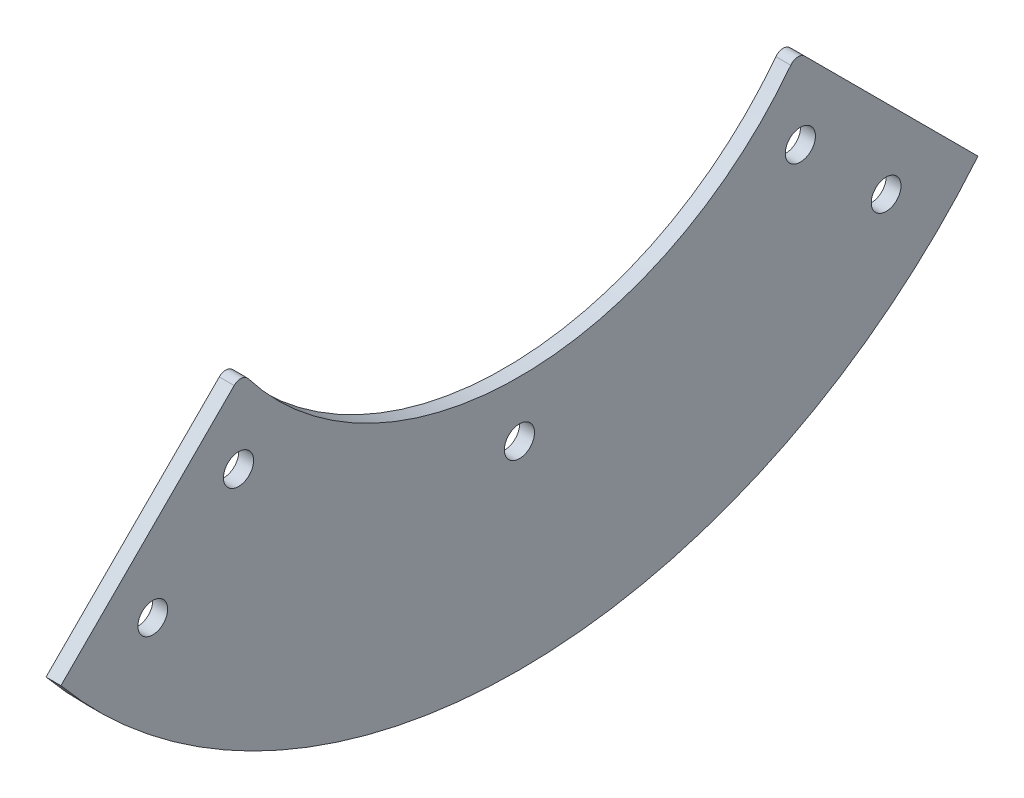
ISO-10303-21;
HEADER;
FILE_DESCRIPTION(('STEP AP214'),'2;1');
FILE_NAME('part.step','',(''),(''),'','','');
FILE_SCHEMA(('AUTOMOTIVE_DESIGN { 1 0 10303 214 1 1 1 1 }'));
ENDSEC;
DATA;
#1=APPLICATION_CONTEXT('core data for automotive mechanical design processes');
#2=APPLICATION_PROTOCOL_DEFINITION('international standard','automotive_design',2000,#1);
#3=PRODUCT_CONTEXT('',#1,'mechanical');
#4=PRODUCT('Part','Part','',(#3));
#5=PRODUCT_RELATED_PRODUCT_CATEGORY('part','',(#4));
#6=PRODUCT_DEFINITION_FORMATION('','',#4);
#7=PRODUCT_DEFINITION_CONTEXT('part definition',#1,'design');
#8=PRODUCT_DEFINITION('design','',#6,#7);
#9=PRODUCT_DEFINITION_SHAPE('','',#8);
#10=(LENGTH_UNIT() NAMED_UNIT(*) SI_UNIT(.MILLI.,.METRE.));
#11=(NAMED_UNIT(*) PLANE_ANGLE_UNIT() SI_UNIT($,.RADIAN.));
#12=(NAMED_UNIT(*) SI_UNIT($,.STERADIAN.) SOLID_ANGLE_UNIT());
#13=UNCERTAINTY_MEASURE_WITH_UNIT(LENGTH_MEASURE(1.E-05),#10,'distance_accuracy_value','');
#14=(GEOMETRIC_REPRESENTATION_CONTEXT(3) GLOBAL_UNCERTAINTY_ASSIGNED_CONTEXT((#13)) GLOBAL_UNIT_ASSIGNED_CONTEXT((#10,
#11,#12)) REPRESENTATION_CONTEXT('',''));
#15=CARTESIAN_POINT('',(0.,0.,0.));
#16=DIRECTION('',(0.,0.,1.));
#17=DIRECTION('',(1.,0.,0.));
#18=AXIS2_PLACEMENT_3D('',#15,#16,#17);
#19=CARTESIAN_POINT('',(4.,-98.55172785,-98.5517278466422));
#20=DIRECTION('',(-1.,0.,0.));
#21=DIRECTION('',(0.,0.,1.));
#22=AXIS2_PLACEMENT_3D('',#19,#20,#21);
#23=CYLINDRICAL_SURFACE('',#22,4.00000000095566);
#24=CARTESIAN_POINT('',(4.,-98.55172785,-98.5517278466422));
#25=DIRECTION('',(1.,0.,0.));
#26=DIRECTION('',(0.,0.,-1.));
#27=AXIS2_PLACEMENT_3D('',#24,#25,#26);
#28=CIRCLE('',#27,4.00000000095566);
#29=CARTESIAN_POINT('',(4.,-98.55172785,-102.551727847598));
#30=VERTEX_POINT('',#29);
#31=EDGE_CURVE('E483',#30,#30,#28,.T.);
#32=ORIENTED_EDGE('',*,*,#31,.T.);
#33=EDGE_LOOP('',(#32));
#34=FACE_BOUND('',#33,.T.);
#35=CARTESIAN_POINT('',(0.,-98.55172785,-98.5517278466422));
#36=DIRECTION('',(1.,0.,0.));
#37=DIRECTION('',(0.,0.,-1.));
#38=AXIS2_PLACEMENT_3D('',#35,#36,#37);
#39=CIRCLE('',#38,4.00000000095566);
#40=CARTESIAN_POINT('',(0.,-98.55172785,-102.551727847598));
#41=VERTEX_POINT('',#40);
#42=EDGE_CURVE('E406',#41,#41,#39,.T.);
#43=ORIENTED_EDGE('',*,*,#42,.F.);
#44=EDGE_LOOP('',(#43));
#45=FACE_BOUND('',#44,.T.);
#46=ADVANCED_FACE('F314',(#34,#45),#23,.F.);
#47=CARTESIAN_POINT('',(0.,0.,0.));
#48=DIRECTION('',(1.,0.,0.));
#49=DIRECTION('',(0.,0.,-1.));
#50=AXIS2_PLACEMENT_3D('',#47,#48,#49);
#51=PLANE('',#50);
#52=CARTESIAN_POINT('',(0.,-75.496317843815,-75.4963178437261));
#53=DIRECTION('',(1.,0.,0.));
#54=DIRECTION('',(0.,0.,-1.));
#55=AXIS2_PLACEMENT_3D('',#52,#53,#54);
#56=CIRCLE('',#55,4.04999999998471);
#57=CARTESIAN_POINT('',(0.,-75.496317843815,-79.5463178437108));
#58=VERTEX_POINT('',#57);
#59=EDGE_CURVE('E397',#58,#58,#56,.T.);
#60=ORIENTED_EDGE('',*,*,#59,.T.);
#61=EDGE_LOOP('',(#60));
#62=FACE_BOUND('',#61,.T.);
#63=CARTESIAN_POINT('',(0.,-75.4963178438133,75.4963178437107));
#64=DIRECTION('',(1.,0.,0.));
#65=DIRECTION('',(0.,0.,-1.));
#66=AXIS2_PLACEMENT_3D('',#63,#64,#65);
#67=CIRCLE('',#66,4.04999999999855);
#68=CARTESIAN_POINT('',(0.,-75.4963178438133,71.4463178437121));
#69=VERTEX_POINT('',#68);
#70=EDGE_CURVE('E400',#69,#69,#67,.T.);
#71=ORIENTED_EDGE('',*,*,#70,.T.);
#72=EDGE_LOOP('',(#71));
#73=FACE_BOUND('',#72,.T.);
#74=CARTESIAN_POINT('',(0.,-98.55172785,98.55172785));
#75=DIRECTION('',(1.,0.,0.));
#76=DIRECTION('',(0.,0.,-1.));
#77=AXIS2_PLACEMENT_3D('',#74,#75,#76);
#78=CIRCLE('',#77,4.00000000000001);
#79=CARTESIAN_POINT('',(0.,-98.55172785,94.55172785));
#80=VERTEX_POINT('',#79);
#81=EDGE_CURVE('E403',#80,#80,#78,.T.);
#82=ORIENTED_EDGE('',*,*,#81,.T.);
#83=EDGE_LOOP('',(#82));
#84=FACE_BOUND('',#83,.T.);
#85=ORIENTED_EDGE('',*,*,#42,.T.);
#86=EDGE_LOOP('',(#85));
#87=FACE_BOUND('',#86,.T.);
#88=CARTESIAN_POINT('',(0.,-106.767916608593,1.55431223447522E-12));
#89=DIRECTION('',(1.,0.,0.));
#90=DIRECTION('',(0.,0.,-1.));
#91=AXIS2_PLACEMENT_3D('',#88,#89,#90);
#92=CIRCLE('',#91,4.049999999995);
#93=CARTESIAN_POINT('',(0.,-106.767916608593,-4.04999999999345));
#94=VERTEX_POINT('',#93);
#95=EDGE_CURVE('E409',#94,#94,#92,.T.);
#96=ORIENTED_EDGE('',*,*,#95,.T.);
#97=EDGE_LOOP('',(#96));
#98=FACE_BOUND('',#97,.T.);
#99=DIRECTION('',(0.,-0.707106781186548,0.707106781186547));
#100=VECTOR('',#99,1.);
#101=CARTESIAN_POINT('',(0.,10.6066017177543,10.6066017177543));
#102=LINE('',#101,#100);
#103=CARTESIAN_POINT('',(0.,-55.4622642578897,76.6754676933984));
#104=VERTEX_POINT('',#103);
#105=CARTESIAN_POINT('',(0.,-102.032201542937,123.245404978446));
#106=VERTEX_POINT('',#105);
#107=EDGE_CURVE('E412',#104,#106,#102,.T.);
#108=ORIENTED_EDGE('',*,*,#107,.F.);
#109=CARTESIAN_POINT('',(0.,-57.2300312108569,74.9077007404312));
#110=DIRECTION('',(1.,0.,0.));
#111=DIRECTION('',(0.,0.,-1.));
#112=AXIS2_PLACEMENT_3D('',#109,#110,#111);
#113=CIRCLE('',#112,2.50000000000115);
#114=CARTESIAN_POINT('',(0.,-55.7122817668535,72.9211367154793));
#115=VERTEX_POINT('',#114);
#116=EDGE_CURVE('E356',#115,#104,#113,.T.);
#117=ORIENTED_EDGE('',*,*,#116,.F.);
#118=CARTESIAN_POINT('',(0.,0.,0.));
#119=DIRECTION('',(1.,0.,0.));
#120=DIRECTION('',(0.,0.,-1.));
#121=AXIS2_PLACEMENT_3D('',#118,#119,#120);
#122=CIRCLE('',#121,91.7679166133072);
#123=CARTESIAN_POINT('',(0.,-55.7122817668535,-72.9211367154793));
#124=VERTEX_POINT('',#123);
#125=EDGE_CURVE('E422',#115,#124,#122,.T.);
#126=ORIENTED_EDGE('',*,*,#125,.T.);
#127=CARTESIAN_POINT('',(0.,-57.2300312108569,-74.9077007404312));
#128=DIRECTION('',(1.,0.,0.));
#129=DIRECTION('',(0.,0.,-1.));
#130=AXIS2_PLACEMENT_3D('',#127,#128,#129);
#131=CIRCLE('',#130,2.50000000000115);
#132=CARTESIAN_POINT('',(0.,-55.4622642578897,-76.6754676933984));
#133=VERTEX_POINT('',#132);
#134=EDGE_CURVE('E385',#133,#124,#131,.T.);
#135=ORIENTED_EDGE('',*,*,#134,.F.);
#136=DIRECTION('',(0.,-0.707106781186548,-0.707106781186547));
#137=VECTOR('',#136,1.);
#138=CARTESIAN_POINT('',(0.,10.6066017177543,-10.6066017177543));
#139=LINE('',#138,#137);
#140=CARTESIAN_POINT('',(0.,-102.032201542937,-123.245404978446));
#141=VERTEX_POINT('',#140);
#142=EDGE_CURVE('E418',#133,#141,#139,.T.);
#143=ORIENTED_EDGE('',*,*,#142,.T.);
#144=CARTESIAN_POINT('',(0.,0.,0.));
#145=DIRECTION('',(1.,0.,0.));
#146=DIRECTION('',(0.,0.,-1.));
#147=AXIS2_PLACEMENT_3D('',#144,#145,#146);
#148=CIRCLE('',#147,159.999999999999);
#149=EDGE_CURVE('E415',#106,#141,#148,.T.);
#150=ORIENTED_EDGE('',*,*,#149,.F.);
#151=EDGE_LOOP('',(#108,#117,#126,#135,#143,#150));
#152=FACE_BOUND('',#151,.T.);
#153=ADVANCED_FACE('F435',(#62,#73,#84,#87,#98,#152),#51,.F.);
#154=CARTESIAN_POINT('',(4.,-75.496317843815,-75.4963178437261));
#155=DIRECTION('',(-1.,0.,0.));
#156=DIRECTION('',(0.,0.,1.));
#157=AXIS2_PLACEMENT_3D('',#154,#155,#156);
#158=CYLINDRICAL_SURFACE('',#157,4.04999999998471);
#159=CARTESIAN_POINT('',(4.,-75.496317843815,-75.4963178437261));
#160=DIRECTION('',(1.,0.,0.));
#161=DIRECTION('',(0.,0.,-1.));
#162=AXIS2_PLACEMENT_3D('',#159,#160,#161);
#163=CIRCLE('',#162,4.04999999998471);
#164=CARTESIAN_POINT('',(4.,-75.496317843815,-79.5463178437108));
#165=VERTEX_POINT('',#164);
#166=EDGE_CURVE('E425',#165,#165,#163,.T.);
#167=ORIENTED_EDGE('',*,*,#166,.T.);
#168=EDGE_LOOP('',(#167));
#169=FACE_BOUND('',#168,.T.);
#170=ORIENTED_EDGE('',*,*,#59,.F.);
#171=EDGE_LOOP('',(#170));
#172=FACE_BOUND('',#171,.T.);
#173=ADVANCED_FACE('F316',(#169,#172),#158,.F.);
#174=CARTESIAN_POINT('',(4.,-98.55172785,98.55172785));
#175=DIRECTION('',(-1.,0.,0.));
#176=DIRECTION('',(0.,0.,1.));
#177=AXIS2_PLACEMENT_3D('',#174,#175,#176);
#178=CYLINDRICAL_SURFACE('',#177,4.00000000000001);
#179=CARTESIAN_POINT('',(4.,-98.55172785,98.55172785));
#180=DIRECTION('',(1.,0.,0.));
#181=DIRECTION('',(0.,0.,-1.));
#182=AXIS2_PLACEMENT_3D('',#179,#180,#181);
#183=CIRCLE('',#182,4.00000000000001);
#184=CARTESIAN_POINT('',(4.,-98.55172785,94.55172785));
#185=VERTEX_POINT('',#184);
#186=EDGE_CURVE('E479',#185,#185,#183,.T.);
#187=ORIENTED_EDGE('',*,*,#186,.T.);
#188=EDGE_LOOP('',(#187));
#189=FACE_BOUND('',#188,.T.);
#190=ORIENTED_EDGE('',*,*,#81,.F.);
#191=EDGE_LOOP('',(#190));
#192=FACE_BOUND('',#191,.T.);
#193=ADVANCED_FACE('F457',(#189,#192),#178,.F.);
#194=CARTESIAN_POINT('',(4.,-75.4963178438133,75.4963178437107));
#195=DIRECTION('',(-1.,0.,0.));
#196=DIRECTION('',(0.,0.,1.));
#197=AXIS2_PLACEMENT_3D('',#194,#195,#196);
#198=CYLINDRICAL_SURFACE('',#197,4.04999999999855);
#199=CARTESIAN_POINT('',(4.,-75.4963178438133,75.4963178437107));
#200=DIRECTION('',(1.,0.,0.));
#201=DIRECTION('',(0.,0.,-1.));
#202=AXIS2_PLACEMENT_3D('',#199,#200,#201);
#203=CIRCLE('',#202,4.04999999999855);
#204=CARTESIAN_POINT('',(4.,-75.4963178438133,71.4463178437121));
#205=VERTEX_POINT('',#204);
#206=EDGE_CURVE('E475',#205,#205,#203,.T.);
#207=ORIENTED_EDGE('',*,*,#206,.T.);
#208=EDGE_LOOP('',(#207));
#209=FACE_BOUND('',#208,.T.);
#210=ORIENTED_EDGE('',*,*,#70,.F.);
#211=EDGE_LOOP('',(#210));
#212=FACE_BOUND('',#211,.T.);
#213=ADVANCED_FACE('F498',(#209,#212),#198,.F.);
#214=CARTESIAN_POINT('',(4.,-106.767916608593,1.55431223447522E-12));
#215=DIRECTION('',(-1.,0.,0.));
#216=DIRECTION('',(0.,0.,1.));
#217=AXIS2_PLACEMENT_3D('',#214,#215,#216);
#218=CYLINDRICAL_SURFACE('',#217,4.049999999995);
#219=CARTESIAN_POINT('',(4.,-106.767916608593,1.55431223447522E-12));
#220=DIRECTION('',(1.,0.,0.));
#221=DIRECTION('',(0.,0.,-1.));
#222=AXIS2_PLACEMENT_3D('',#219,#220,#221);
#223=CIRCLE('',#222,4.049999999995);
#224=CARTESIAN_POINT('',(4.,-106.767916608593,-4.04999999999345));
#225=VERTEX_POINT('',#224);
#226=EDGE_CURVE('E486',#225,#225,#223,.T.);
#227=ORIENTED_EDGE('',*,*,#226,.T.);
#228=EDGE_LOOP('',(#227));
#229=FACE_BOUND('',#228,.T.);
#230=ORIENTED_EDGE('',*,*,#95,.F.);
#231=EDGE_LOOP('',(#230));
#232=FACE_BOUND('',#231,.T.);
#233=ADVANCED_FACE('F448',(#229,#232),#218,.F.);
#234=CARTESIAN_POINT('',(4.,10.6066017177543,10.6066017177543));
#235=DIRECTION('',(0.,-0.707106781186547,-0.707106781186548));
#236=DIRECTION('',(0.,0.707106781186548,-0.707106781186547));
#237=AXIS2_PLACEMENT_3D('',#234,#235,#236);
#238=PLANE('',#237);
#239=ORIENTED_EDGE('',*,*,#107,.T.);
#240=DIRECTION('',(-1.,0.,0.));
#241=VECTOR('',#240,1.);
#242=CARTESIAN_POINT('',(4.,-102.032201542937,123.245404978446));
#243=LINE('',#242,#241);
#244=CARTESIAN_POINT('',(4.,-102.032201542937,123.245404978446));
#245=VERTEX_POINT('',#244);
#246=EDGE_CURVE('E12',#245,#106,#243,.T.);
#247=ORIENTED_EDGE('',*,*,#246,.F.);
#248=DIRECTION('',(0.,-0.707106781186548,0.707106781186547));
#249=VECTOR('',#248,1.);
#250=CARTESIAN_POINT('',(4.,10.6066017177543,10.6066017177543));
#251=LINE('',#250,#249);
#252=CARTESIAN_POINT('',(4.,-55.4622642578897,76.6754676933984));
#253=VERTEX_POINT('',#252);
#254=EDGE_CURVE('E439',#253,#245,#251,.T.);
#255=ORIENTED_EDGE('',*,*,#254,.F.);
#256=DIRECTION('',(-1.,0.,0.));
#257=VECTOR('',#256,1.);
#258=CARTESIAN_POINT('',(4.,-55.4622642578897,76.6754676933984));
#259=LINE('',#258,#257);
#260=EDGE_CURVE('E393',#253,#104,#259,.T.);
#261=ORIENTED_EDGE('',*,*,#260,.T.);
#262=EDGE_LOOP('',(#239,#247,#255,#261));
#263=FACE_BOUND('',#262,.T.);
#264=ADVANCED_FACE('F437',(#263),#238,.F.);
#265=CARTESIAN_POINT('',(4.,-57.2300312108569,74.9077007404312));
#266=DIRECTION('',(-1.,0.,0.));
#267=DIRECTION('',(0.,0.,1.));
#268=AXIS2_PLACEMENT_3D('',#265,#266,#267);
#269=CYLINDRICAL_SURFACE('',#268,2.50000000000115);
#270=ORIENTED_EDGE('',*,*,#116,.T.);
#271=ORIENTED_EDGE('',*,*,#260,.F.);
#272=CARTESIAN_POINT('',(4.,-57.2300312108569,74.9077007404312));
#273=DIRECTION('',(1.,0.,0.));
#274=DIRECTION('',(0.,0.,-1.));
#275=AXIS2_PLACEMENT_3D('',#272,#273,#274);
#276=CIRCLE('',#275,2.50000000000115);
#277=CARTESIAN_POINT('',(4.,-55.7122817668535,72.9211367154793));
#278=VERTEX_POINT('',#277);
#279=EDGE_CURVE('E331',#278,#253,#276,.T.);
#280=ORIENTED_EDGE('',*,*,#279,.F.);
#281=DIRECTION('',(-1.,0.,0.));
#282=VECTOR('',#281,1.);
#283=CARTESIAN_POINT('',(4.,-55.7122817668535,72.9211367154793));
#284=LINE('',#283,#282);
#285=EDGE_CURVE('E353',#278,#115,#284,.T.);
#286=ORIENTED_EDGE('',*,*,#285,.T.);
#287=EDGE_LOOP('',(#270,#271,#280,#286));
#288=FACE_BOUND('',#287,.T.);
#289=ADVANCED_FACE('F440',(#288),#269,.T.);
#290=CARTESIAN_POINT('',(4.,0.,0.));
#291=DIRECTION('',(-1.,0.,0.));
#292=DIRECTION('',(0.,0.,1.));
#293=AXIS2_PLACEMENT_3D('',#290,#291,#292);
#294=CYLINDRICAL_SURFACE('',#293,91.7679166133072);
#295=ORIENTED_EDGE('',*,*,#125,.F.);
#296=ORIENTED_EDGE('',*,*,#285,.F.);
#297=CARTESIAN_POINT('',(4.,0.,0.));
#298=DIRECTION('',(1.,0.,0.));
#299=DIRECTION('',(0.,0.,-1.));
#300=AXIS2_PLACEMENT_3D('',#297,#298,#299);
#301=CIRCLE('',#300,91.7679166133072);
#302=CARTESIAN_POINT('',(4.,-55.7122817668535,-72.9211367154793));
#303=VERTEX_POINT('',#302);
#304=EDGE_CURVE('E376',#278,#303,#301,.T.);
#305=ORIENTED_EDGE('',*,*,#304,.T.);
#306=DIRECTION('',(-1.,0.,0.));
#307=VECTOR('',#306,1.);
#308=CARTESIAN_POINT('',(4.,-55.7122817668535,-72.9211367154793));
#309=LINE('',#308,#307);
#310=EDGE_CURVE('E382',#303,#124,#309,.T.);
#311=ORIENTED_EDGE('',*,*,#310,.T.);
#312=EDGE_LOOP('',(#295,#296,#305,#311));
#313=FACE_BOUND('',#312,.T.);
#314=ADVANCED_FACE('F391',(#313),#294,.F.);
#315=CARTESIAN_POINT('',(4.,-57.2300312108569,-74.9077007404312));
#316=DIRECTION('',(-1.,0.,0.));
#317=DIRECTION('',(0.,0.,1.));
#318=AXIS2_PLACEMENT_3D('',#315,#316,#317);
#319=CYLINDRICAL_SURFACE('',#318,2.50000000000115);
#320=ORIENTED_EDGE('',*,*,#134,.T.);
#321=ORIENTED_EDGE('',*,*,#310,.F.);
#322=CARTESIAN_POINT('',(4.,-57.2300312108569,-74.9077007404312));
#323=DIRECTION('',(1.,0.,0.));
#324=DIRECTION('',(0.,0.,-1.));
#325=AXIS2_PLACEMENT_3D('',#322,#323,#324);
#326=CIRCLE('',#325,2.50000000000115);
#327=CARTESIAN_POINT('',(4.,-55.4622642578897,-76.6754676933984));
#328=VERTEX_POINT('',#327);
#329=EDGE_CURVE('E372',#328,#303,#326,.T.);
#330=ORIENTED_EDGE('',*,*,#329,.F.);
#331=DIRECTION('',(-1.,0.,0.));
#332=VECTOR('',#331,1.);
#333=CARTESIAN_POINT('',(4.,-55.4622642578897,-76.6754676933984));
#334=LINE('',#333,#332);
#335=EDGE_CURVE('E389',#328,#133,#334,.T.);
#336=ORIENTED_EDGE('',*,*,#335,.T.);
#337=EDGE_LOOP('',(#320,#321,#330,#336));
#338=FACE_BOUND('',#337,.T.);
#339=ADVANCED_FACE('F383',(#338),#319,.T.);
#340=CARTESIAN_POINT('',(4.,10.6066017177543,-10.6066017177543));
#341=DIRECTION('',(0.,0.707106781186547,-0.707106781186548));
#342=DIRECTION('',(0.,0.707106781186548,0.707106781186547));
#343=AXIS2_PLACEMENT_3D('',#340,#341,#342);
#344=PLANE('',#343);
#345=ORIENTED_EDGE('',*,*,#142,.F.);
#346=ORIENTED_EDGE('',*,*,#335,.F.);
#347=DIRECTION('',(0.,-0.707106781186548,-0.707106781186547));
#348=VECTOR('',#347,1.);
#349=CARTESIAN_POINT('',(4.,10.6066017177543,-10.6066017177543));
#350=LINE('',#349,#348);
#351=CARTESIAN_POINT('',(4.,-102.032201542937,-123.245404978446));
#352=VERTEX_POINT('',#351);
#353=EDGE_CURVE('E378',#328,#352,#350,.T.);
#354=ORIENTED_EDGE('',*,*,#353,.T.);
#355=DIRECTION('',(-1.,0.,0.));
#356=VECTOR('',#355,1.);
#357=CARTESIAN_POINT('',(4.,-102.032201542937,-123.245404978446));
#358=LINE('',#357,#356);
#359=EDGE_CURVE('E323',#352,#141,#358,.T.);
#360=ORIENTED_EDGE('',*,*,#359,.T.);
#361=EDGE_LOOP('',(#345,#346,#354,#360));
#362=FACE_BOUND('',#361,.T.);
#363=ADVANCED_FACE('F430',(#362),#344,.T.);
#364=CARTESIAN_POINT('',(4.,0.,0.));
#365=DIRECTION('',(-1.,0.,0.));
#366=DIRECTION('',(0.,0.,1.));
#367=AXIS2_PLACEMENT_3D('',#364,#365,#366);
#368=CYLINDRICAL_SURFACE('',#367,159.999999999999);
#369=ORIENTED_EDGE('',*,*,#149,.T.);
#370=ORIENTED_EDGE('',*,*,#359,.F.);
#371=CARTESIAN_POINT('',(4.,0.,0.));
#372=DIRECTION('',(1.,0.,0.));
#373=DIRECTION('',(0.,0.,-1.));
#374=AXIS2_PLACEMENT_3D('',#371,#372,#373);
#375=CIRCLE('',#374,159.999999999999);
#376=EDGE_CURVE('E364',#245,#352,#375,.T.);
#377=ORIENTED_EDGE('',*,*,#376,.F.);
#378=ORIENTED_EDGE('',*,*,#246,.T.);
#379=EDGE_LOOP('',(#369,#370,#377,#378));
#380=FACE_BOUND('',#379,.T.);
#381=ADVANCED_FACE('F431',(#380),#368,.T.);
#382=CARTESIAN_POINT('',(4.,0.,0.));
#383=DIRECTION('',(1.,0.,0.));
#384=DIRECTION('',(0.,0.,-1.));
#385=AXIS2_PLACEMENT_3D('',#382,#383,#384);
#386=PLANE('',#385);
#387=ORIENTED_EDGE('',*,*,#166,.F.);
#388=EDGE_LOOP('',(#387));
#389=FACE_BOUND('',#388,.T.);
#390=ORIENTED_EDGE('',*,*,#206,.F.);
#391=EDGE_LOOP('',(#390));
#392=FACE_BOUND('',#391,.T.);
#393=ORIENTED_EDGE('',*,*,#186,.F.);
#394=EDGE_LOOP('',(#393));
#395=FACE_BOUND('',#394,.T.);
#396=ORIENTED_EDGE('',*,*,#31,.F.);
#397=EDGE_LOOP('',(#396));
#398=FACE_BOUND('',#397,.T.);
#399=ORIENTED_EDGE('',*,*,#226,.F.);
#400=EDGE_LOOP('',(#399));
#401=FACE_BOUND('',#400,.T.);
#402=ORIENTED_EDGE('',*,*,#254,.T.);
#403=ORIENTED_EDGE('',*,*,#376,.T.);
#404=ORIENTED_EDGE('',*,*,#353,.F.);
#405=ORIENTED_EDGE('',*,*,#329,.T.);
#406=ORIENTED_EDGE('',*,*,#304,.F.);
#407=ORIENTED_EDGE('',*,*,#279,.T.);
#408=EDGE_LOOP('',(#402,#403,#404,#405,#406,#407));
#409=FACE_BOUND('',#408,.T.);
#410=ADVANCED_FACE('F374',(#389,#392,#395,#398,#401,#409),#386,.T.);
#411=CLOSED_SHELL('',(#46,#153,#173,#193,#213,#233,#264,#289,#314,#339,#363,#381,#410));
#412=MANIFOLD_SOLID_BREP('B2',#411);
#413=ADVANCED_BREP_SHAPE_REPRESENTATION('',(#18,#412),#14);
#414=SHAPE_DEFINITION_REPRESENTATION(#9,#413);
ENDSEC;
END-ISO-10303-21;
